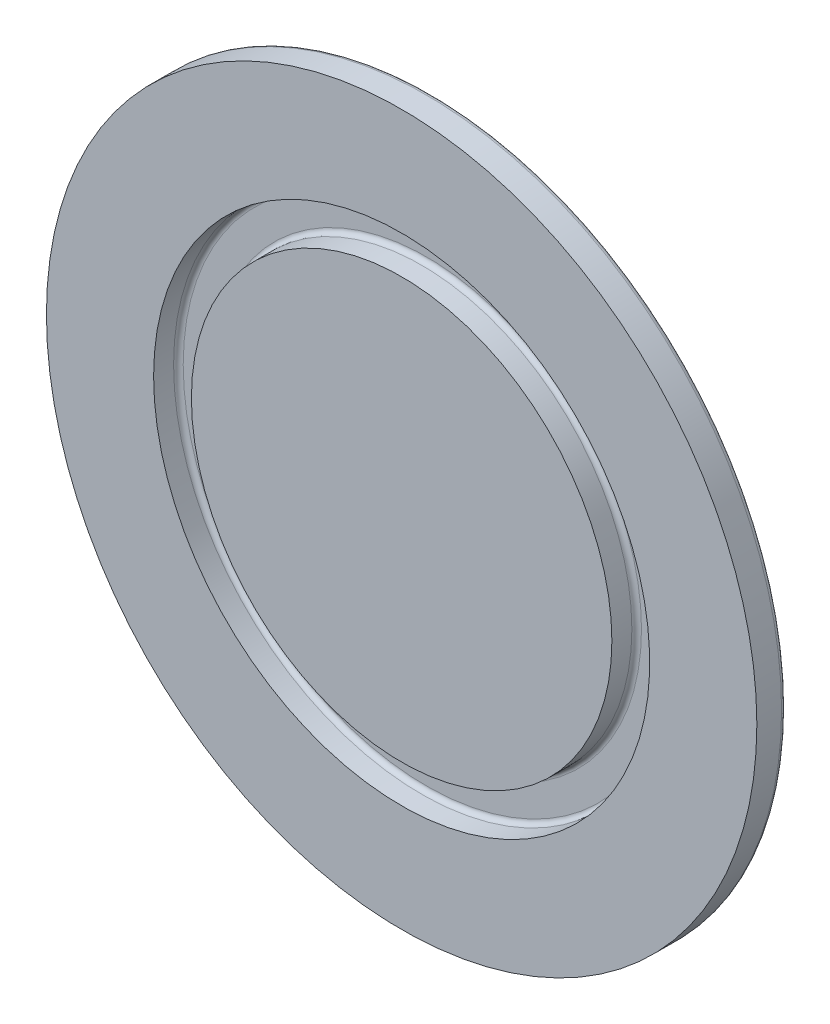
ISO-10303-21;
HEADER;
FILE_DESCRIPTION(('STEP AP214'),'2;1');
FILE_NAME('part.step','',(''),(''),'','','');
FILE_SCHEMA(('AUTOMOTIVE_DESIGN { 1 0 10303 214 1 1 1 1 }'));
ENDSEC;
DATA;
#1=APPLICATION_CONTEXT('core data for automotive mechanical design processes');
#2=APPLICATION_PROTOCOL_DEFINITION('international standard','automotive_design',2000,#1);
#3=PRODUCT_CONTEXT('',#1,'mechanical');
#4=PRODUCT('Part','Part','',(#3));
#5=PRODUCT_RELATED_PRODUCT_CATEGORY('part','',(#4));
#6=PRODUCT_DEFINITION_FORMATION('','',#4);
#7=PRODUCT_DEFINITION_CONTEXT('part definition',#1,'design');
#8=PRODUCT_DEFINITION('design','',#6,#7);
#9=PRODUCT_DEFINITION_SHAPE('','',#8);
#10=(LENGTH_UNIT() NAMED_UNIT(*) SI_UNIT(.MILLI.,.METRE.));
#11=(NAMED_UNIT(*) PLANE_ANGLE_UNIT() SI_UNIT($,.RADIAN.));
#12=(NAMED_UNIT(*) SI_UNIT($,.STERADIAN.) SOLID_ANGLE_UNIT());
#13=UNCERTAINTY_MEASURE_WITH_UNIT(LENGTH_MEASURE(1.E-05),#10,'distance_accuracy_value','');
#14=(GEOMETRIC_REPRESENTATION_CONTEXT(3) GLOBAL_UNCERTAINTY_ASSIGNED_CONTEXT((#13)) GLOBAL_UNIT_ASSIGNED_CONTEXT((#10,
#11,#12)) REPRESENTATION_CONTEXT('',''));
#15=CARTESIAN_POINT('',(0.,0.,0.));
#16=DIRECTION('',(0.,0.,1.));
#17=DIRECTION('',(1.,0.,0.));
#18=AXIS2_PLACEMENT_3D('',#15,#16,#17);
#19=CARTESIAN_POINT('',(0.,0.,-2.54));
#20=DIRECTION('',(0.,0.,1.));
#21=DIRECTION('',(1.,0.,0.));
#22=AXIS2_PLACEMENT_3D('',#19,#20,#21);
#23=CONICAL_SURFACE('',#22,29.6918845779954,1.30899693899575);
#24=CARTESIAN_POINT('',(0.,0.,-0.558088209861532));
#25=DIRECTION('',(0.,0.,-1.));
#26=DIRECTION('',(-1.,0.,0.));
#27=AXIS2_PLACEMENT_3D('',#24,#25,#26);
#28=CIRCLE('',#27,37.0884800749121);
#29=CARTESIAN_POINT('',(-37.0884800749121,0.,-0.558088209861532));
#30=VERTEX_POINT('',#29);
#31=EDGE_CURVE('E66',#30,#30,#28,.T.);
#32=ORIENTED_EDGE('',*,*,#31,.T.);
#33=EDGE_LOOP('',(#32));
#34=FACE_BOUND('',#33,.T.);
#35=CARTESIAN_POINT('',(0.,0.,-2.54));
#36=DIRECTION('',(0.,0.,-1.));
#37=DIRECTION('',(-1.,0.,0.));
#38=AXIS2_PLACEMENT_3D('',#35,#36,#37);
#39=CIRCLE('',#38,29.6918845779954);
#40=CARTESIAN_POINT('',(-29.6918845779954,0.,-2.54));
#41=VERTEX_POINT('',#40);
#42=EDGE_CURVE('E10',#41,#41,#39,.T.);
#43=ORIENTED_EDGE('',*,*,#42,.F.);
#44=EDGE_LOOP('',(#43));
#45=FACE_BOUND('',#44,.T.);
#46=ADVANCED_FACE('F32',(#34,#45),#23,.T.);
#47=CARTESIAN_POINT('',(0.,29.6918845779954,-2.54));
#48=DIRECTION('',(0.,0.,-1.));
#49=DIRECTION('',(-1.,0.,0.));
#50=AXIS2_PLACEMENT_3D('',#47,#48,#49);
#51=PLANE('',#50);
#52=ORIENTED_EDGE('',*,*,#42,.T.);
#53=EDGE_LOOP('',(#52));
#54=FACE_BOUND('',#53,.T.);
#55=ADVANCED_FACE('F84',(#54),#51,.T.);
#56=CARTESIAN_POINT('',(0.,0.,2.54));
#57=DIRECTION('',(0.,0.,1.));
#58=DIRECTION('',(1.,0.,0.));
#59=AXIS2_PLACEMENT_3D('',#56,#57,#58);
#60=PLANE('',#59);
#61=CARTESIAN_POINT('',(0.,0.,2.53999999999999));
#62=DIRECTION('',(0.,0.,-1.));
#63=DIRECTION('',(-1.,0.,0.));
#64=AXIS2_PLACEMENT_3D('',#61,#62,#63);
#65=CIRCLE('',#64,22.1742);
#66=CARTESIAN_POINT('',(-22.1742,0.,2.53999999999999));
#67=VERTEX_POINT('',#66);
#68=EDGE_CURVE('E38',#67,#67,#65,.T.);
#69=ORIENTED_EDGE('',*,*,#68,.F.);
#70=EDGE_LOOP('',(#69));
#71=FACE_BOUND('',#70,.T.);
#72=ADVANCED_FACE('F88',(#71),#60,.T.);
#73=CARTESIAN_POINT('',(0.,0.,-2.54));
#74=DIRECTION('',(0.,0.,-1.));
#75=DIRECTION('',(-1.,0.,0.));
#76=AXIS2_PLACEMENT_3D('',#73,#74,#75);
#77=CYLINDRICAL_SURFACE('',#76,22.1742);
#78=ORIENTED_EDGE('',*,*,#68,.T.);
#79=EDGE_LOOP('',(#78));
#80=FACE_BOUND('',#79,.T.);
#81=CARTESIAN_POINT('',(0.,0.,0.431800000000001));
#82=DIRECTION('',(0.,0.,-1.));
#83=DIRECTION('',(-1.,0.,0.));
#84=AXIS2_PLACEMENT_3D('',#81,#82,#83);
#85=CIRCLE('',#84,22.1742);
#86=CARTESIAN_POINT('',(-22.1742,0.,0.431800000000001));
#87=VERTEX_POINT('',#86);
#88=EDGE_CURVE('E42',#87,#87,#85,.T.);
#89=ORIENTED_EDGE('',*,*,#88,.F.);
#90=EDGE_LOOP('',(#89));
#91=FACE_BOUND('',#90,.T.);
#92=ADVANCED_FACE('F92',(#80,#91),#77,.T.);
#93=CARTESIAN_POINT('',(0.,0.,0.431800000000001));
#94=DIRECTION('',(0.,0.,-1.));
#95=DIRECTION('',(-1.,0.,0.));
#96=AXIS2_PLACEMENT_3D('',#93,#94,#95);
#97=TOROIDAL_SURFACE('',#96,22.6822,0.508000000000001);
#98=ORIENTED_EDGE('',*,*,#88,.T.);
#99=EDGE_LOOP('',(#98));
#100=FACE_BOUND('',#99,.T.);
#101=CARTESIAN_POINT('',(0.,0.,-0.0761999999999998));
#102=DIRECTION('',(0.,0.,-1.));
#103=DIRECTION('',(-1.,0.,0.));
#104=AXIS2_PLACEMENT_3D('',#101,#102,#103);
#105=CIRCLE('',#104,22.6822);
#106=CARTESIAN_POINT('',(-22.6822,0.,-0.0761999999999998));
#107=VERTEX_POINT('',#106);
#108=EDGE_CURVE('E46',#107,#107,#105,.T.);
#109=ORIENTED_EDGE('',*,*,#108,.F.);
#110=EDGE_LOOP('',(#109));
#111=FACE_BOUND('',#110,.T.);
#112=ADVANCED_FACE('F98',(#100,#111),#97,.F.);
#113=CARTESIAN_POINT('',(0.,22.6822,-0.0761999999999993));
#114=DIRECTION('',(0.,0.,1.));
#115=DIRECTION('',(1.,0.,0.));
#116=AXIS2_PLACEMENT_3D('',#113,#114,#115);
#117=PLANE('',#116);
#118=ORIENTED_EDGE('',*,*,#108,.T.);
#119=EDGE_LOOP('',(#118));
#120=FACE_BOUND('',#119,.T.);
#121=CARTESIAN_POINT('',(0.,0.,-0.0761999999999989));
#122=DIRECTION('',(0.,0.,-1.));
#123=DIRECTION('',(-1.,0.,0.));
#124=AXIS2_PLACEMENT_3D('',#121,#122,#123);
#125=CIRCLE('',#124,25.654);
#126=CARTESIAN_POINT('',(-25.654,0.,-0.0761999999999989));
#127=VERTEX_POINT('',#126);
#128=EDGE_CURVE('E51',#127,#127,#125,.T.);
#129=ORIENTED_EDGE('',*,*,#128,.F.);
#130=EDGE_LOOP('',(#129));
#131=FACE_BOUND('',#130,.T.);
#132=ADVANCED_FACE('F101',(#120,#131),#117,.T.);
#133=CARTESIAN_POINT('',(0.,0.,0.431800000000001));
#134=DIRECTION('',(0.,0.,-1.));
#135=DIRECTION('',(-1.,0.,0.));
#136=AXIS2_PLACEMENT_3D('',#133,#134,#135);
#137=TOROIDAL_SURFACE('',#136,25.654,0.508000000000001);
#138=ORIENTED_EDGE('',*,*,#128,.T.);
#139=EDGE_LOOP('',(#138));
#140=FACE_BOUND('',#139,.T.);
#141=CARTESIAN_POINT('',(0.,0.,0.431800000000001));
#142=DIRECTION('',(0.,0.,-1.));
#143=DIRECTION('',(-1.,0.,0.));
#144=AXIS2_PLACEMENT_3D('',#141,#142,#143);
#145=CIRCLE('',#144,26.162);
#146=CARTESIAN_POINT('',(-26.162,0.,0.431800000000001));
#147=VERTEX_POINT('',#146);
#148=EDGE_CURVE('E54',#147,#147,#145,.T.);
#149=ORIENTED_EDGE('',*,*,#148,.F.);
#150=EDGE_LOOP('',(#149));
#151=FACE_BOUND('',#150,.T.);
#152=ADVANCED_FACE('F105',(#140,#151),#137,.F.);
#153=CARTESIAN_POINT('',(0.,0.,-2.54));
#154=DIRECTION('',(0.,0.,-1.));
#155=DIRECTION('',(-1.,0.,0.));
#156=AXIS2_PLACEMENT_3D('',#153,#154,#155);
#157=CYLINDRICAL_SURFACE('',#156,26.162);
#158=ORIENTED_EDGE('',*,*,#148,.T.);
#159=EDGE_LOOP('',(#158));
#160=FACE_BOUND('',#159,.T.);
#161=CARTESIAN_POINT('',(0.,0.,2.54));
#162=DIRECTION('',(0.,0.,-1.));
#163=DIRECTION('',(-1.,0.,0.));
#164=AXIS2_PLACEMENT_3D('',#161,#162,#163);
#165=CIRCLE('',#164,26.162);
#166=CARTESIAN_POINT('',(-26.162,0.,2.54));
#167=VERTEX_POINT('',#166);
#168=EDGE_CURVE('E57',#167,#167,#165,.T.);
#169=ORIENTED_EDGE('',*,*,#168,.F.);
#170=EDGE_LOOP('',(#169));
#171=FACE_BOUND('',#170,.T.);
#172=ADVANCED_FACE('F109',(#160,#171),#157,.F.);
#173=CARTESIAN_POINT('',(0.,26.162,2.54));
#174=DIRECTION('',(0.,0.,1.));
#175=DIRECTION('',(1.,0.,0.));
#176=AXIS2_PLACEMENT_3D('',#173,#174,#175);
#177=PLANE('',#176);
#178=ORIENTED_EDGE('',*,*,#168,.T.);
#179=EDGE_LOOP('',(#178));
#180=FACE_BOUND('',#179,.T.);
#181=CARTESIAN_POINT('',(0.,0.,2.54));
#182=DIRECTION('',(0.,0.,-1.));
#183=DIRECTION('',(-1.,0.,0.));
#184=AXIS2_PLACEMENT_3D('',#181,#182,#183);
#185=CIRCLE('',#184,37.465);
#186=CARTESIAN_POINT('',(-37.465,0.,2.54));
#187=VERTEX_POINT('',#186);
#188=EDGE_CURVE('E60',#187,#187,#185,.T.);
#189=ORIENTED_EDGE('',*,*,#188,.F.);
#190=EDGE_LOOP('',(#189));
#191=FACE_BOUND('',#190,.T.);
#192=ADVANCED_FACE('F80',(#180,#191),#177,.T.);
#193=CARTESIAN_POINT('',(0.,0.,-2.54));
#194=DIRECTION('',(0.,0.,-1.));
#195=DIRECTION('',(-1.,0.,0.));
#196=AXIS2_PLACEMENT_3D('',#193,#194,#195);
#197=CYLINDRICAL_SURFACE('',#196,37.465);
#198=ORIENTED_EDGE('',*,*,#188,.T.);
#199=EDGE_LOOP('',(#198));
#200=FACE_BOUND('',#199,.T.);
#201=CARTESIAN_POINT('',(0.,0.,-0.067397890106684));
#202=DIRECTION('',(0.,0.,-1.));
#203=DIRECTION('',(-1.,0.,0.));
#204=AXIS2_PLACEMENT_3D('',#201,#202,#203);
#205=CIRCLE('',#204,37.465);
#206=CARTESIAN_POINT('',(-37.465,0.,-0.067397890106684));
#207=VERTEX_POINT('',#206);
#208=EDGE_CURVE('E63',#207,#207,#205,.T.);
#209=ORIENTED_EDGE('',*,*,#208,.F.);
#210=EDGE_LOOP('',(#209));
#211=FACE_BOUND('',#210,.T.);
#212=ADVANCED_FACE('F74',(#200,#211),#197,.T.);
#213=CARTESIAN_POINT('',(0.,0.,-0.067397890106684));
#214=DIRECTION('',(0.,0.,-1.));
#215=DIRECTION('',(-1.,0.,0.));
#216=AXIS2_PLACEMENT_3D('',#213,#214,#215);
#217=TOROIDAL_SURFACE('',#216,36.957,0.508000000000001);
#218=ORIENTED_EDGE('',*,*,#208,.T.);
#219=EDGE_LOOP('',(#218));
#220=FACE_BOUND('',#219,.T.);
#221=ORIENTED_EDGE('',*,*,#31,.F.);
#222=EDGE_LOOP('',(#221));
#223=FACE_BOUND('',#222,.T.);
#224=ADVANCED_FACE('F72',(#220,#223),#217,.T.);
#225=CLOSED_SHELL('',(#46,#55,#72,#92,#112,#132,#152,#172,#192,#212,#224));
#226=MANIFOLD_SOLID_BREP('B2',#225);
#227=ADVANCED_BREP_SHAPE_REPRESENTATION('',(#18,#226),#14);
#228=SHAPE_DEFINITION_REPRESENTATION(#9,#227);
ENDSEC;
END-ISO-10303-21;
